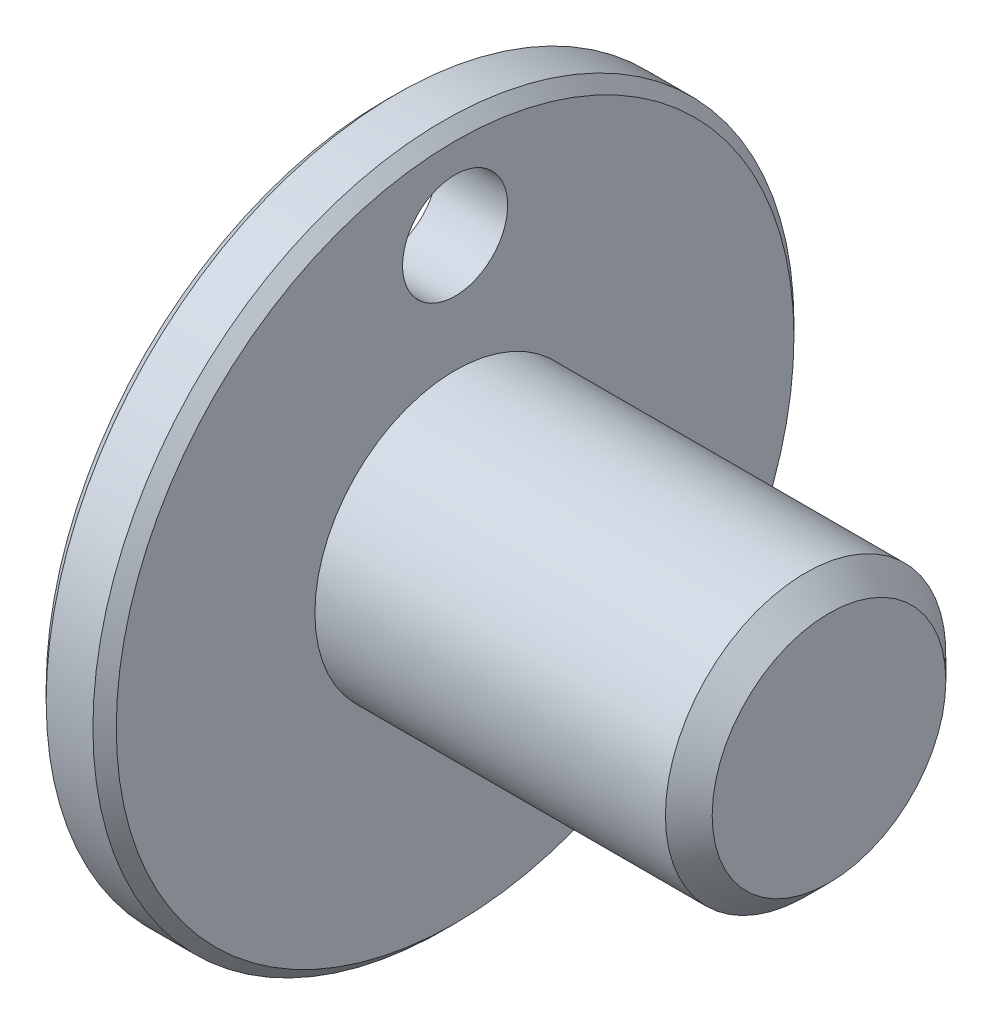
ISO-10303-21;
HEADER;
FILE_DESCRIPTION(('STEP AP214'),'2;1');
FILE_NAME('part.step','',(''),(''),'','','');
FILE_SCHEMA(('AUTOMOTIVE_DESIGN { 1 0 10303 214 1 1 1 1 }'));
ENDSEC;
DATA;
#1=APPLICATION_CONTEXT('core data for automotive mechanical design processes');
#2=APPLICATION_PROTOCOL_DEFINITION('international standard','automotive_design',2000,#1);
#3=PRODUCT_CONTEXT('',#1,'mechanical');
#4=PRODUCT('Part','Part','',(#3));
#5=PRODUCT_RELATED_PRODUCT_CATEGORY('part','',(#4));
#6=PRODUCT_DEFINITION_FORMATION('','',#4);
#7=PRODUCT_DEFINITION_CONTEXT('part definition',#1,'design');
#8=PRODUCT_DEFINITION('design','',#6,#7);
#9=PRODUCT_DEFINITION_SHAPE('','',#8);
#10=(LENGTH_UNIT() NAMED_UNIT(*) SI_UNIT(.MILLI.,.METRE.));
#11=(NAMED_UNIT(*) PLANE_ANGLE_UNIT() SI_UNIT($,.RADIAN.));
#12=(NAMED_UNIT(*) SI_UNIT($,.STERADIAN.) SOLID_ANGLE_UNIT());
#13=UNCERTAINTY_MEASURE_WITH_UNIT(LENGTH_MEASURE(1.E-05),#10,'distance_accuracy_value','');
#14=(GEOMETRIC_REPRESENTATION_CONTEXT(3) GLOBAL_UNCERTAINTY_ASSIGNED_CONTEXT((#13)) GLOBAL_UNIT_ASSIGNED_CONTEXT((#10,
#11,#12)) REPRESENTATION_CONTEXT('',''));
#15=CARTESIAN_POINT('',(0.,0.,0.));
#16=DIRECTION('',(0.,0.,1.));
#17=DIRECTION('',(1.,0.,0.));
#18=AXIS2_PLACEMENT_3D('',#15,#16,#17);
#19=CARTESIAN_POINT('',(-27.3367071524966,0.,0.));
#20=DIRECTION('',(-1.,0.,0.));
#21=DIRECTION('',(0.,0.,1.));
#22=AXIS2_PLACEMENT_3D('',#19,#20,#21);
#23=CYLINDRICAL_SURFACE('',#22,15.);
#24=CARTESIAN_POINT('',(-2.5,0.,0.));
#25=DIRECTION('',(1.,0.,0.));
#26=DIRECTION('',(0.,0.,-1.));
#27=AXIS2_PLACEMENT_3D('',#24,#25,#26);
#28=CIRCLE('',#27,15.);
#29=CARTESIAN_POINT('',(-2.5,0.,-15.));
#30=VERTEX_POINT('',#29);
#31=EDGE_CURVE('E38',#30,#30,#28,.T.);
#32=ORIENTED_EDGE('',*,*,#31,.T.);
#33=EDGE_LOOP('',(#32));
#34=FACE_BOUND('',#33,.T.);
#35=CARTESIAN_POINT('',(-0.5,0.,0.));
#36=DIRECTION('',(-1.,0.,0.));
#37=DIRECTION('',(0.,0.,1.));
#38=AXIS2_PLACEMENT_3D('',#35,#36,#37);
#39=CIRCLE('',#38,15.);
#40=CARTESIAN_POINT('',(-0.5,0.,15.));
#41=VERTEX_POINT('',#40);
#42=EDGE_CURVE('E42',#41,#41,#39,.T.);
#43=ORIENTED_EDGE('',*,*,#42,.T.);
#44=EDGE_LOOP('',(#43));
#45=FACE_BOUND('',#44,.T.);
#46=ADVANCED_FACE('F32',(#34,#45),#23,.T.);
#47=CARTESIAN_POINT('',(0.,15.,0.));
#48=DIRECTION('',(-1.,0.,0.));
#49=DIRECTION('',(0.,0.,1.));
#50=AXIS2_PLACEMENT_3D('',#47,#48,#49);
#51=PLANE('',#50);
#52=CARTESIAN_POINT('',(0.,11.,0.));
#53=DIRECTION('',(-1.,0.,0.));
#54=DIRECTION('',(0.,0.,1.));
#55=AXIS2_PLACEMENT_3D('',#52,#53,#54);
#56=CIRCLE('',#55,2.25);
#57=CARTESIAN_POINT('',(0.,11.,2.25));
#58=VERTEX_POINT('',#57);
#59=EDGE_CURVE('E60',#58,#58,#56,.T.);
#60=ORIENTED_EDGE('',*,*,#59,.T.);
#61=EDGE_LOOP('',(#60));
#62=FACE_BOUND('',#61,.T.);
#63=CARTESIAN_POINT('',(0.,0.,0.));
#64=DIRECTION('',(-1.,0.,0.));
#65=DIRECTION('',(0.,0.,1.));
#66=AXIS2_PLACEMENT_3D('',#63,#64,#65);
#67=CIRCLE('',#66,14.5);
#68=CARTESIAN_POINT('',(0.,0.,14.5));
#69=VERTEX_POINT('',#68);
#70=EDGE_CURVE('E10',#69,#69,#67,.F.);
#71=ORIENTED_EDGE('',*,*,#70,.T.);
#72=EDGE_LOOP('',(#71));
#73=FACE_BOUND('',#72,.T.);
#74=CARTESIAN_POINT('',(0.,0.,0.));
#75=DIRECTION('',(-1.,0.,0.));
#76=DIRECTION('',(0.,0.,1.));
#77=AXIS2_PLACEMENT_3D('',#74,#75,#76);
#78=CIRCLE('',#77,6.);
#79=CARTESIAN_POINT('',(0.,0.,6.));
#80=VERTEX_POINT('',#79);
#81=EDGE_CURVE('E57',#80,#80,#78,.T.);
#82=ORIENTED_EDGE('',*,*,#81,.T.);
#83=EDGE_LOOP('',(#82));
#84=FACE_BOUND('',#83,.T.);
#85=ADVANCED_FACE('F92',(#62,#73,#84),#51,.F.);
#86=CARTESIAN_POINT('',(-27.3367071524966,0.,0.));
#87=DIRECTION('',(-1.,0.,0.));
#88=DIRECTION('',(0.,0.,1.));
#89=AXIS2_PLACEMENT_3D('',#86,#87,#88);
#90=CYLINDRICAL_SURFACE('',#89,6.);
#91=CARTESIAN_POINT('',(15.,0.,0.));
#92=DIRECTION('',(-1.,0.,0.));
#93=DIRECTION('',(0.,0.,1.));
#94=AXIS2_PLACEMENT_3D('',#91,#92,#93);
#95=CIRCLE('',#94,6.);
#96=CARTESIAN_POINT('',(15.,0.,6.));
#97=VERTEX_POINT('',#96);
#98=EDGE_CURVE('E54',#97,#97,#95,.T.);
#99=ORIENTED_EDGE('',*,*,#98,.T.);
#100=EDGE_LOOP('',(#99));
#101=FACE_BOUND('',#100,.T.);
#102=ORIENTED_EDGE('',*,*,#81,.F.);
#103=EDGE_LOOP('',(#102));
#104=FACE_BOUND('',#103,.T.);
#105=ADVANCED_FACE('F96',(#101,#104),#90,.T.);
#106=CARTESIAN_POINT('',(16.,6.,0.));
#107=DIRECTION('',(-1.,0.,0.));
#108=DIRECTION('',(0.,0.,1.));
#109=AXIS2_PLACEMENT_3D('',#106,#107,#108);
#110=PLANE('',#109);
#111=CARTESIAN_POINT('',(16.,0.,0.));
#112=DIRECTION('',(-1.,0.,0.));
#113=DIRECTION('',(0.,0.,1.));
#114=AXIS2_PLACEMENT_3D('',#111,#112,#113);
#115=CIRCLE('',#114,5.);
#116=CARTESIAN_POINT('',(16.,0.,5.));
#117=VERTEX_POINT('',#116);
#118=EDGE_CURVE('E51',#117,#117,#115,.F.);
#119=ORIENTED_EDGE('',*,*,#118,.T.);
#120=EDGE_LOOP('',(#119));
#121=FACE_BOUND('',#120,.T.);
#122=ADVANCED_FACE('F74',(#121),#110,.F.);
#123=CARTESIAN_POINT('',(-3.,0.,0.));
#124=DIRECTION('',(1.,0.,0.));
#125=DIRECTION('',(0.,0.,-1.));
#126=AXIS2_PLACEMENT_3D('',#123,#124,#125);
#127=PLANE('',#126);
#128=CARTESIAN_POINT('',(-3.,11.,0.));
#129=DIRECTION('',(-1.,0.,0.));
#130=DIRECTION('',(0.,0.,1.));
#131=AXIS2_PLACEMENT_3D('',#128,#129,#130);
#132=CIRCLE('',#131,2.25);
#133=CARTESIAN_POINT('',(-3.,11.,2.25));
#134=VERTEX_POINT('',#133);
#135=EDGE_CURVE('E63',#134,#134,#132,.T.);
#136=ORIENTED_EDGE('',*,*,#135,.F.);
#137=EDGE_LOOP('',(#136));
#138=FACE_BOUND('',#137,.T.);
#139=CARTESIAN_POINT('',(-3.,0.,0.));
#140=DIRECTION('',(1.,0.,0.));
#141=DIRECTION('',(0.,0.,-1.));
#142=AXIS2_PLACEMENT_3D('',#139,#140,#141);
#143=CIRCLE('',#142,14.5);
#144=CARTESIAN_POINT('',(-3.,0.,-14.5));
#145=VERTEX_POINT('',#144);
#146=EDGE_CURVE('E46',#145,#145,#143,.F.);
#147=ORIENTED_EDGE('',*,*,#146,.T.);
#148=EDGE_LOOP('',(#147));
#149=FACE_BOUND('',#148,.T.);
#150=ADVANCED_FACE('F70',(#138,#149),#127,.F.);
#151=CARTESIAN_POINT('',(15.,0.,0.));
#152=DIRECTION('',(-1.,0.,0.));
#153=DIRECTION('',(0.,0.,1.));
#154=AXIS2_PLACEMENT_3D('',#151,#152,#153);
#155=CONICAL_SURFACE('',#154,6.,0.78539816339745);
#156=ORIENTED_EDGE('',*,*,#118,.F.);
#157=EDGE_LOOP('',(#156));
#158=FACE_BOUND('',#157,.T.);
#159=ORIENTED_EDGE('',*,*,#98,.F.);
#160=EDGE_LOOP('',(#159));
#161=FACE_BOUND('',#160,.T.);
#162=ADVANCED_FACE('F73',(#158,#161),#155,.T.);
#163=CARTESIAN_POINT('',(-3.,0.,0.));
#164=DIRECTION('',(1.,0.,0.));
#165=DIRECTION('',(0.,0.,-1.));
#166=AXIS2_PLACEMENT_3D('',#163,#164,#165);
#167=CONICAL_SURFACE('',#166,14.5,0.785398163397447);
#168=ORIENTED_EDGE('',*,*,#31,.F.);
#169=EDGE_LOOP('',(#168));
#170=FACE_BOUND('',#169,.T.);
#171=ORIENTED_EDGE('',*,*,#146,.F.);
#172=EDGE_LOOP('',(#171));
#173=FACE_BOUND('',#172,.T.);
#174=ADVANCED_FACE('F78',(#170,#173),#167,.T.);
#175=CARTESIAN_POINT('',(-0.5,0.,0.));
#176=DIRECTION('',(-1.,0.,0.));
#177=DIRECTION('',(0.,0.,1.));
#178=AXIS2_PLACEMENT_3D('',#175,#176,#177);
#179=CONICAL_SURFACE('',#178,15.,0.78539816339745);
#180=ORIENTED_EDGE('',*,*,#70,.F.);
#181=EDGE_LOOP('',(#180));
#182=FACE_BOUND('',#181,.T.);
#183=ORIENTED_EDGE('',*,*,#42,.F.);
#184=EDGE_LOOP('',(#183));
#185=FACE_BOUND('',#184,.T.);
#186=ADVANCED_FACE('F80',(#182,#185),#179,.T.);
#187=CARTESIAN_POINT('',(16.,11.,0.));
#188=DIRECTION('',(-1.,0.,0.));
#189=DIRECTION('',(0.,0.,1.));
#190=AXIS2_PLACEMENT_3D('',#187,#188,#189);
#191=CYLINDRICAL_SURFACE('',#190,2.25);
#192=ORIENTED_EDGE('',*,*,#135,.T.);
#193=EDGE_LOOP('',(#192));
#194=FACE_BOUND('',#193,.T.);
#195=ORIENTED_EDGE('',*,*,#59,.F.);
#196=EDGE_LOOP('',(#195));
#197=FACE_BOUND('',#196,.T.);
#198=ADVANCED_FACE('F67',(#194,#197),#191,.F.);
#199=CLOSED_SHELL('',(#46,#85,#105,#122,#150,#162,#174,#186,#198));
#200=MANIFOLD_SOLID_BREP('B2',#199);
#201=ADVANCED_BREP_SHAPE_REPRESENTATION('',(#18,#200),#14);
#202=SHAPE_DEFINITION_REPRESENTATION(#9,#201);
ENDSEC;
END-ISO-10303-21;
